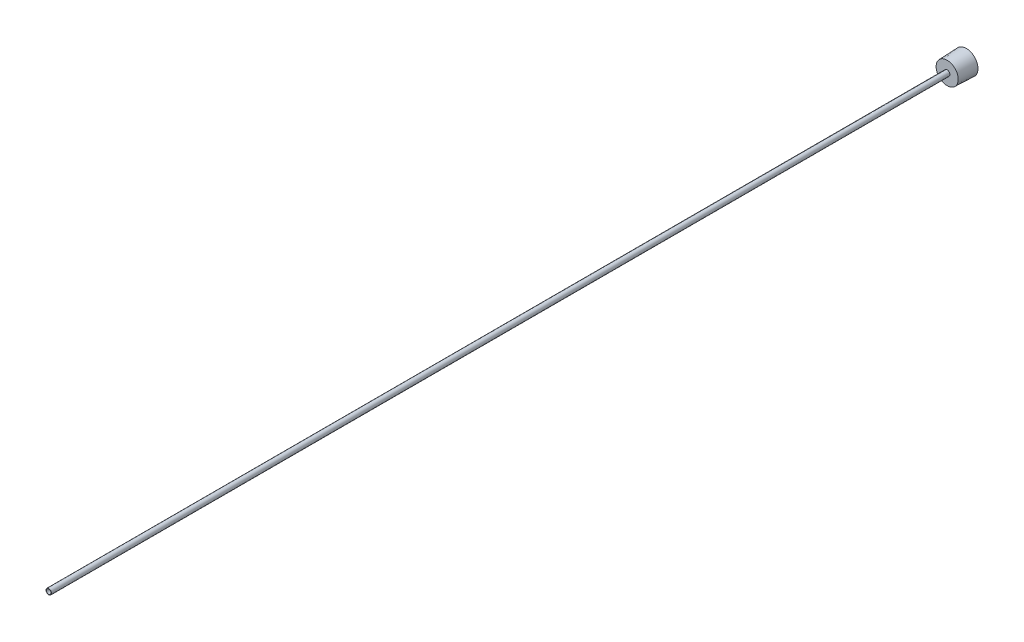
ISO-10303-21;
HEADER;
FILE_DESCRIPTION(('STEP AP214'),'2;1');
FILE_NAME('part.step','',(''),(''),'','','');
FILE_SCHEMA(('AUTOMOTIVE_DESIGN { 1 0 10303 214 1 1 1 1 }'));
ENDSEC;
DATA;
#1=APPLICATION_CONTEXT('core data for automotive mechanical design processes');
#2=APPLICATION_PROTOCOL_DEFINITION('international standard','automotive_design',2000,#1);
#3=PRODUCT_CONTEXT('',#1,'mechanical');
#4=PRODUCT('Part','Part','',(#3));
#5=PRODUCT_RELATED_PRODUCT_CATEGORY('part','',(#4));
#6=PRODUCT_DEFINITION_FORMATION('','',#4);
#7=PRODUCT_DEFINITION_CONTEXT('part definition',#1,'design');
#8=PRODUCT_DEFINITION('design','',#6,#7);
#9=PRODUCT_DEFINITION_SHAPE('','',#8);
#10=(LENGTH_UNIT() NAMED_UNIT(*) SI_UNIT(.MILLI.,.METRE.));
#11=(NAMED_UNIT(*) PLANE_ANGLE_UNIT() SI_UNIT($,.RADIAN.));
#12=(NAMED_UNIT(*) SI_UNIT($,.STERADIAN.) SOLID_ANGLE_UNIT());
#13=UNCERTAINTY_MEASURE_WITH_UNIT(LENGTH_MEASURE(1.E-05),#10,'distance_accuracy_value','');
#14=(GEOMETRIC_REPRESENTATION_CONTEXT(3) GLOBAL_UNCERTAINTY_ASSIGNED_CONTEXT((#13)) GLOBAL_UNIT_ASSIGNED_CONTEXT((#10,
#11,#12)) REPRESENTATION_CONTEXT('',''));
#15=CARTESIAN_POINT('',(0.,0.,0.));
#16=DIRECTION('',(0.,0.,1.));
#17=DIRECTION('',(1.,0.,0.));
#18=AXIS2_PLACEMENT_3D('',#15,#16,#17);
#19=CARTESIAN_POINT('',(0.,0.,0.));
#20=DIRECTION('',(0.,0.,1.));
#21=DIRECTION('',(1.,0.,0.));
#22=AXIS2_PLACEMENT_3D('',#19,#20,#21);
#23=CYLINDRICAL_SURFACE('',#22,0.762);
#24=CARTESIAN_POINT('',(0.,0.,304.8));
#25=DIRECTION('',(0.,0.,1.));
#26=DIRECTION('',(1.,0.,0.));
#27=AXIS2_PLACEMENT_3D('',#24,#25,#26);
#28=CIRCLE('',#27,0.762);
#29=CARTESIAN_POINT('',(0.762,0.,304.8));
#30=VERTEX_POINT('',#29);
#31=EDGE_CURVE('E142',#30,#30,#28,.T.);
#32=CARTESIAN_POINT('',(0.,0.,3.96875));
#33=DIRECTION('',(0.,0.,-1.));
#34=DIRECTION('',(-1.,0.,0.));
#35=AXIS2_PLACEMENT_3D('',#32,#33,#34);
#36=CIRCLE('',#35,0.762);
#37=CARTESIAN_POINT('',(0.762,0.,3.96875));
#38=VERTEX_POINT('',#37);
#39=EDGE_CURVE('E37',#38,#38,#36,.F.);
#40=CARTESIAN_POINT('',(0.762,0.,304.8));
#41=CARTESIAN_POINT('',(0.762,0.,301.666341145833));
#42=CARTESIAN_POINT('',(0.762,0.,298.532682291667));
#43=CARTESIAN_POINT('',(0.762,0.,292.265364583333));
#44=CARTESIAN_POINT('',(0.762,0.,289.131705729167));
#45=CARTESIAN_POINT('',(0.762,0.,282.864388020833));
#46=CARTESIAN_POINT('',(0.762,0.,279.730729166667));
#47=CARTESIAN_POINT('',(0.762,0.,273.463411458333));
#48=CARTESIAN_POINT('',(0.762,0.,270.329752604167));
#49=CARTESIAN_POINT('',(0.762,0.,264.062434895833));
#50=CARTESIAN_POINT('',(0.762,0.,260.928776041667));
#51=CARTESIAN_POINT('',(0.762,0.,254.661458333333));
#52=CARTESIAN_POINT('',(0.762,0.,251.527799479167));
#53=CARTESIAN_POINT('',(0.762,0.,245.260481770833));
#54=CARTESIAN_POINT('',(0.762,0.,242.126822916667));
#55=CARTESIAN_POINT('',(0.762,0.,235.859505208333));
#56=CARTESIAN_POINT('',(0.762,0.,232.725846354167));
#57=CARTESIAN_POINT('',(0.762,0.,226.458528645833));
#58=CARTESIAN_POINT('',(0.762,0.,223.324869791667));
#59=CARTESIAN_POINT('',(0.762,0.,217.057552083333));
#60=CARTESIAN_POINT('',(0.762,0.,213.923893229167));
#61=CARTESIAN_POINT('',(0.762,0.,207.656575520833));
#62=CARTESIAN_POINT('',(0.762,0.,204.522916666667));
#63=CARTESIAN_POINT('',(0.762,0.,198.255598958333));
#64=CARTESIAN_POINT('',(0.762,0.,195.121940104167));
#65=CARTESIAN_POINT('',(0.762,0.,188.854622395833));
#66=CARTESIAN_POINT('',(0.762,0.,185.720963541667));
#67=CARTESIAN_POINT('',(0.762,0.,179.453645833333));
#68=CARTESIAN_POINT('',(0.762,0.,176.319986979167));
#69=CARTESIAN_POINT('',(0.762,0.,170.052669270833));
#70=CARTESIAN_POINT('',(0.762,0.,166.919010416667));
#71=CARTESIAN_POINT('',(0.762,0.,160.651692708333));
#72=CARTESIAN_POINT('',(0.762,0.,157.518033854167));
#73=CARTESIAN_POINT('',(0.762,0.,151.250716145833));
#74=CARTESIAN_POINT('',(0.762,0.,148.117057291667));
#75=CARTESIAN_POINT('',(0.762,0.,141.849739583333));
#76=CARTESIAN_POINT('',(0.762,0.,138.716080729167));
#77=CARTESIAN_POINT('',(0.762,0.,132.448763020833));
#78=CARTESIAN_POINT('',(0.762,0.,129.315104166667));
#79=CARTESIAN_POINT('',(0.762,0.,123.047786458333));
#80=CARTESIAN_POINT('',(0.762,0.,119.914127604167));
#81=CARTESIAN_POINT('',(0.762,0.,113.646809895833));
#82=CARTESIAN_POINT('',(0.762,0.,110.513151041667));
#83=CARTESIAN_POINT('',(0.762,0.,104.245833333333));
#84=CARTESIAN_POINT('',(0.762,0.,101.112174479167));
#85=CARTESIAN_POINT('',(0.762,0.,94.8448567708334));
#86=CARTESIAN_POINT('',(0.762,0.,91.7111979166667));
#87=CARTESIAN_POINT('',(0.762,0.,85.4438802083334));
#88=CARTESIAN_POINT('',(0.762,0.,82.3102213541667));
#89=CARTESIAN_POINT('',(0.762,0.,76.0429036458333));
#90=CARTESIAN_POINT('',(0.762,0.,72.9092447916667));
#91=CARTESIAN_POINT('',(0.762,0.,66.6419270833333));
#92=CARTESIAN_POINT('',(0.762,0.,63.5082682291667));
#93=CARTESIAN_POINT('',(0.762,0.,57.2409505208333));
#94=CARTESIAN_POINT('',(0.762,0.,54.1072916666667));
#95=CARTESIAN_POINT('',(0.762,0.,47.8399739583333));
#96=CARTESIAN_POINT('',(0.762,0.,44.7063151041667));
#97=CARTESIAN_POINT('',(0.762,0.,38.4389973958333));
#98=CARTESIAN_POINT('',(0.762,0.,35.3053385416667));
#99=CARTESIAN_POINT('',(0.762,0.,29.0380208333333));
#100=CARTESIAN_POINT('',(0.762,0.,25.9043619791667));
#101=CARTESIAN_POINT('',(0.762,0.,19.6370442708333));
#102=CARTESIAN_POINT('',(0.762,0.,16.5033854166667));
#103=CARTESIAN_POINT('',(0.762,0.,10.2360677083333));
#104=CARTESIAN_POINT('',(0.762,0.,7.10240885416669));
#105=CARTESIAN_POINT('',(0.762,0.,3.96875000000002));
#106=B_SPLINE_CURVE_WITH_KNOTS('',3,(#40,#41,#42,#43,#44,#45,#46,#47,#48,#49,#50,#51,#52,#53,
#54,#55,#56,#57,#58,#59,#60,#61,#62,#63,#64,#65,#66,#67,#68,#69,#70,#71,#72,#73,#74,#75,#76,#77,
#78,#79,#80,#81,#82,#83,#84,#85,#86,#87,#88,#89,#90,#91,#92,#93,#94,#95,#96,#97,#98,#99,#100,
#101,#102,#103,#104,#105),.UNSPECIFIED.,.F.,.F.,(4,2,2,2,2,2,2,2,2,2,2,2,2,2,2,2,2,2,2,2,2,2,2,
2,2,2,2,2,2,2,2,2,4),(0.,9.4009765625,18.801953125,28.2029296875,37.60390625,47.0048828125,
56.405859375,65.8068359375,75.2078125,84.6087890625,94.009765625,103.4107421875,112.81171875,
122.2126953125,131.613671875,141.0146484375,150.415625,159.8166015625,169.217578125,
178.6185546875,188.01953125,197.4205078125,206.821484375,216.2224609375,225.6234375,
235.0244140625,244.425390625,253.8263671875,263.22734375,272.6283203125,282.029296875,
291.4302734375,300.83125),.UNSPECIFIED.);
#107=EDGE_CURVE('BSEAM33',#30,#38,#106,.T.);
#108=ORIENTED_EDGE('',*,*,#31,.T.);
#109=ORIENTED_EDGE('',*,*,#39,.F.);
#110=ORIENTED_EDGE('',*,*,#107,.T.);
#111=ORIENTED_EDGE('',*,*,#107,.F.);
#112=EDGE_LOOP('',(#108,#110,#109,#111));
#113=FACE_BOUND('',#112,.T.);
#114=ADVANCED_FACE('F33',(#113),#23,.F.);
#115=CARTESIAN_POINT('',(0.,0.,0.));
#116=DIRECTION('',(0.,0.,1.));
#117=DIRECTION('',(1.,0.,0.));
#118=AXIS2_PLACEMENT_3D('',#115,#116,#117);
#119=PLANE('',#118);
#120=DIRECTION('',(-0.866025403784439,0.5,0.));
#121=VECTOR('',#120,1.);
#122=CARTESIAN_POINT('',(0.,-2.74963065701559,0.));
#123=LINE('',#122,#121);
#124=CARTESIAN_POINT('',(0.,-2.74963065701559,0.));
#125=VERTEX_POINT('',#124);
#126=CARTESIAN_POINT('',(-2.38125,-1.3748153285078,0.));
#127=VERTEX_POINT('',#126);
#128=EDGE_CURVE('E124',#125,#127,#123,.T.);
#129=ORIENTED_EDGE('',*,*,#128,.F.);
#130=DIRECTION('',(-0.866025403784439,-0.5,0.));
#131=VECTOR('',#130,1.);
#132=CARTESIAN_POINT('',(2.38125,-1.3748153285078,0.));
#133=LINE('',#132,#131);
#134=CARTESIAN_POINT('',(2.38125,-1.3748153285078,0.));
#135=VERTEX_POINT('',#134);
#136=EDGE_CURVE('E49',#135,#125,#133,.T.);
#137=ORIENTED_EDGE('',*,*,#136,.F.);
#138=DIRECTION('',(0.,-1.,0.));
#139=VECTOR('',#138,1.);
#140=CARTESIAN_POINT('',(2.38125,1.3748153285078,0.));
#141=LINE('',#140,#139);
#142=CARTESIAN_POINT('',(2.38125,1.3748153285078,0.));
#143=VERTEX_POINT('',#142);
#144=EDGE_CURVE('E133',#143,#135,#141,.T.);
#145=ORIENTED_EDGE('',*,*,#144,.F.);
#146=DIRECTION('',(0.866025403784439,-0.5,0.));
#147=VECTOR('',#146,1.);
#148=CARTESIAN_POINT('',(0.,2.74963065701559,0.));
#149=LINE('',#148,#147);
#150=CARTESIAN_POINT('',(0.,2.74963065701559,0.));
#151=VERTEX_POINT('',#150);
#152=EDGE_CURVE('E131',#151,#143,#149,.T.);
#153=ORIENTED_EDGE('',*,*,#152,.F.);
#154=DIRECTION('',(0.866025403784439,0.5,0.));
#155=VECTOR('',#154,1.);
#156=CARTESIAN_POINT('',(-2.38125,1.3748153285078,0.));
#157=LINE('',#156,#155);
#158=CARTESIAN_POINT('',(-2.38125,1.3748153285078,0.));
#159=VERTEX_POINT('',#158);
#160=EDGE_CURVE('E97',#159,#151,#157,.T.);
#161=ORIENTED_EDGE('',*,*,#160,.F.);
#162=DIRECTION('',(0.,1.,0.));
#163=VECTOR('',#162,1.);
#164=CARTESIAN_POINT('',(-2.38125,-1.3748153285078,0.));
#165=LINE('',#164,#163);
#166=EDGE_CURVE('E127',#127,#159,#165,.T.);
#167=ORIENTED_EDGE('',*,*,#166,.F.);
#168=EDGE_LOOP('',(#129,#137,#145,#153,#161,#167));
#169=FACE_BOUND('',#168,.T.);
#170=CARTESIAN_POINT('',(0.,0.,0.));
#171=DIRECTION('',(0.,0.,1.));
#172=DIRECTION('',(1.,0.,0.));
#173=AXIS2_PLACEMENT_3D('',#170,#171,#172);
#174=CIRCLE('',#173,3.8989);
#175=CARTESIAN_POINT('',(3.8989,0.,0.));
#176=VERTEX_POINT('',#175);
#177=EDGE_CURVE('E11',#176,#176,#174,.T.);
#178=ORIENTED_EDGE('',*,*,#177,.F.);
#179=EDGE_LOOP('',(#178));
#180=FACE_BOUND('',#179,.T.);
#181=ADVANCED_FACE('F35',(#169,#180),#119,.F.);
#182=CARTESIAN_POINT('',(0.,0.,0.));
#183=DIRECTION('',(0.,0.,-1.));
#184=DIRECTION('',(-1.,0.,0.));
#185=AXIS2_PLACEMENT_3D('',#182,#183,#184);
#186=CONICAL_SURFACE('',#185,3.8989,0.0364424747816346);
#187=CARTESIAN_POINT('',(0.,0.,6.35));
#188=DIRECTION('',(0.,0.,1.));
#189=DIRECTION('',(1.,0.,0.));
#190=AXIS2_PLACEMENT_3D('',#187,#188,#189);
#191=CIRCLE('',#190,3.66738778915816);
#192=CARTESIAN_POINT('',(3.66738778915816,0.,6.35));
#193=VERTEX_POINT('',#192);
#194=EDGE_CURVE('E42',#193,#193,#191,.T.);
#195=ORIENTED_EDGE('',*,*,#194,.F.);
#196=EDGE_LOOP('',(#195));
#197=FACE_BOUND('',#196,.T.);
#198=ORIENTED_EDGE('',*,*,#177,.T.);
#199=EDGE_LOOP('',(#198));
#200=FACE_BOUND('',#199,.T.);
#201=ADVANCED_FACE('F156',(#197,#200),#186,.T.);
#202=CARTESIAN_POINT('',(0.,3.66738778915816,6.35));
#203=DIRECTION('',(0.,0.,-1.));
#204=DIRECTION('',(-1.,0.,0.));
#205=AXIS2_PLACEMENT_3D('',#202,#203,#204);
#206=PLANE('',#205);
#207=CARTESIAN_POINT('',(0.,0.,6.35));
#208=DIRECTION('',(0.,0.,1.));
#209=DIRECTION('',(1.,0.,0.));
#210=AXIS2_PLACEMENT_3D('',#207,#208,#209);
#211=CIRCLE('',#210,0.9144);
#212=CARTESIAN_POINT('',(0.9144,0.,6.35));
#213=VERTEX_POINT('',#212);
#214=EDGE_CURVE('E148',#213,#213,#211,.T.);
#215=ORIENTED_EDGE('',*,*,#214,.F.);
#216=EDGE_LOOP('',(#215));
#217=FACE_BOUND('',#216,.T.);
#218=ORIENTED_EDGE('',*,*,#194,.T.);
#219=EDGE_LOOP('',(#218));
#220=FACE_BOUND('',#219,.T.);
#221=ADVANCED_FACE('F154',(#217,#220),#206,.F.);
#222=CARTESIAN_POINT('',(0.,0.,0.));
#223=DIRECTION('',(0.,0.,1.));
#224=DIRECTION('',(1.,0.,0.));
#225=AXIS2_PLACEMENT_3D('',#222,#223,#224);
#226=CYLINDRICAL_SURFACE('',#225,0.914399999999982);
#227=CARTESIAN_POINT('',(0.,0.,304.8));
#228=DIRECTION('',(0.,0.,1.));
#229=DIRECTION('',(1.,0.,0.));
#230=AXIS2_PLACEMENT_3D('',#227,#228,#229);
#231=CIRCLE('',#230,0.914399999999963);
#232=CARTESIAN_POINT('',(0.914399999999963,0.,304.8));
#233=VERTEX_POINT('',#232);
#234=EDGE_CURVE('E145',#233,#233,#231,.T.);
#235=ORIENTED_EDGE('',*,*,#234,.F.);
#236=EDGE_LOOP('',(#235));
#237=FACE_BOUND('',#236,.T.);
#238=ORIENTED_EDGE('',*,*,#214,.T.);
#239=EDGE_LOOP('',(#238));
#240=FACE_BOUND('',#239,.T.);
#241=ADVANCED_FACE('F190',(#237,#240),#226,.T.);
#242=CARTESIAN_POINT('',(0.,0.914399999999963,304.8));
#243=DIRECTION('',(0.,0.,-1.));
#244=DIRECTION('',(-1.,0.,0.));
#245=AXIS2_PLACEMENT_3D('',#242,#243,#244);
#246=PLANE('',#245);
#247=ORIENTED_EDGE('',*,*,#31,.F.);
#248=EDGE_LOOP('',(#247));
#249=FACE_BOUND('',#248,.T.);
#250=ORIENTED_EDGE('',*,*,#234,.T.);
#251=EDGE_LOOP('',(#250));
#252=FACE_BOUND('',#251,.T.);
#253=ADVANCED_FACE('F183',(#249,#252),#246,.F.);
#254=CARTESIAN_POINT('',(0.,-2.74963065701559,3.96875));
#255=DIRECTION('',(0.,0.,-1.));
#256=DIRECTION('',(-1.,0.,0.));
#257=AXIS2_PLACEMENT_3D('',#254,#255,#256);
#258=PLANE('',#257);
#259=DIRECTION('',(-0.866025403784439,-0.5,0.));
#260=VECTOR('',#259,1.);
#261=CARTESIAN_POINT('',(2.38125,-1.3748153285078,3.96875));
#262=LINE('',#261,#260);
#263=CARTESIAN_POINT('',(2.38125,-1.3748153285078,3.96875));
#264=VERTEX_POINT('',#263);
#265=CARTESIAN_POINT('',(0.,-2.74963065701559,3.96875));
#266=VERTEX_POINT('',#265);
#267=EDGE_CURVE('E135',#264,#266,#262,.T.);
#268=ORIENTED_EDGE('',*,*,#267,.T.);
#269=DIRECTION('',(-0.866025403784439,0.5,0.));
#270=VECTOR('',#269,1.);
#271=CARTESIAN_POINT('',(0.,-2.74963065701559,3.96875));
#272=LINE('',#271,#270);
#273=CARTESIAN_POINT('',(-2.38125,-1.3748153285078,3.96875));
#274=VERTEX_POINT('',#273);
#275=EDGE_CURVE('E118',#266,#274,#272,.T.);
#276=ORIENTED_EDGE('',*,*,#275,.T.);
#277=DIRECTION('',(0.,1.,0.));
#278=VECTOR('',#277,1.);
#279=CARTESIAN_POINT('',(-2.38125,-1.3748153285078,3.96875));
#280=LINE('',#279,#278);
#281=CARTESIAN_POINT('',(-2.38125,1.3748153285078,3.96875));
#282=VERTEX_POINT('',#281);
#283=EDGE_CURVE('E116',#274,#282,#280,.T.);
#284=ORIENTED_EDGE('',*,*,#283,.T.);
#285=DIRECTION('',(0.866025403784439,0.5,0.));
#286=VECTOR('',#285,1.);
#287=CARTESIAN_POINT('',(-2.38125,1.3748153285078,3.96875));
#288=LINE('',#287,#286);
#289=CARTESIAN_POINT('',(0.,2.74963065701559,3.96875));
#290=VERTEX_POINT('',#289);
#291=EDGE_CURVE('E94',#282,#290,#288,.T.);
#292=ORIENTED_EDGE('',*,*,#291,.T.);
#293=DIRECTION('',(0.866025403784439,-0.5,0.));
#294=VECTOR('',#293,1.);
#295=CARTESIAN_POINT('',(0.,2.74963065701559,3.96875));
#296=LINE('',#295,#294);
#297=CARTESIAN_POINT('',(2.38125,1.3748153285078,3.96875));
#298=VERTEX_POINT('',#297);
#299=EDGE_CURVE('E105',#290,#298,#296,.T.);
#300=ORIENTED_EDGE('',*,*,#299,.T.);
#301=DIRECTION('',(0.,-1.,0.));
#302=VECTOR('',#301,1.);
#303=CARTESIAN_POINT('',(2.38125,1.3748153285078,3.96875));
#304=LINE('',#303,#302);
#305=EDGE_CURVE('E109',#298,#264,#304,.T.);
#306=ORIENTED_EDGE('',*,*,#305,.T.);
#307=EDGE_LOOP('',(#268,#276,#284,#292,#300,#306));
#308=FACE_BOUND('',#307,.T.);
#309=ORIENTED_EDGE('',*,*,#39,.T.);
#310=EDGE_LOOP('',(#309));
#311=FACE_BOUND('',#310,.T.);
#312=ADVANCED_FACE('F112',(#308,#311),#258,.T.);
#313=CARTESIAN_POINT('',(2.38125,-1.3748153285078,3.96875));
#314=DIRECTION('',(0.5,-0.866025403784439,0.));
#315=DIRECTION('',(0.866025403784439,0.5,0.));
#316=AXIS2_PLACEMENT_3D('',#313,#314,#315);
#317=PLANE('',#316);
#318=ORIENTED_EDGE('',*,*,#136,.T.);
#319=DIRECTION('',(0.,0.,-1.));
#320=VECTOR('',#319,1.);
#321=CARTESIAN_POINT('',(0.,-2.74963065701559,3.96875));
#322=LINE('',#321,#320);
#323=EDGE_CURVE('E79',#266,#125,#322,.T.);
#324=ORIENTED_EDGE('',*,*,#323,.F.);
#325=ORIENTED_EDGE('',*,*,#267,.F.);
#326=DIRECTION('',(0.,0.,-1.));
#327=VECTOR('',#326,1.);
#328=CARTESIAN_POINT('',(2.38125,-1.3748153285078,3.96875));
#329=LINE('',#328,#327);
#330=EDGE_CURVE('E57',#264,#135,#329,.T.);
#331=ORIENTED_EDGE('',*,*,#330,.T.);
#332=EDGE_LOOP('',(#318,#324,#325,#331));
#333=FACE_BOUND('',#332,.T.);
#334=ADVANCED_FACE('F174',(#333),#317,.F.);
#335=CARTESIAN_POINT('',(2.38125,1.3748153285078,3.96875));
#336=DIRECTION('',(1.,0.,0.));
#337=DIRECTION('',(0.,0.,-1.));
#338=AXIS2_PLACEMENT_3D('',#335,#336,#337);
#339=PLANE('',#338);
#340=ORIENTED_EDGE('',*,*,#144,.T.);
#341=ORIENTED_EDGE('',*,*,#330,.F.);
#342=ORIENTED_EDGE('',*,*,#305,.F.);
#343=DIRECTION('',(0.,0.,-1.));
#344=VECTOR('',#343,1.);
#345=CARTESIAN_POINT('',(2.38125,1.3748153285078,3.96875));
#346=LINE('',#345,#344);
#347=EDGE_CURVE('E101',#298,#143,#346,.T.);
#348=ORIENTED_EDGE('',*,*,#347,.T.);
#349=EDGE_LOOP('',(#340,#341,#342,#348));
#350=FACE_BOUND('',#349,.T.);
#351=ADVANCED_FACE('F176',(#350),#339,.F.);
#352=CARTESIAN_POINT('',(0.,2.74963065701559,3.96875));
#353=DIRECTION('',(0.5,0.866025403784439,0.));
#354=DIRECTION('',(-0.866025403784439,0.5,0.));
#355=AXIS2_PLACEMENT_3D('',#352,#353,#354);
#356=PLANE('',#355);
#357=ORIENTED_EDGE('',*,*,#152,.T.);
#358=ORIENTED_EDGE('',*,*,#347,.F.);
#359=ORIENTED_EDGE('',*,*,#299,.F.);
#360=DIRECTION('',(0.,0.,-1.));
#361=VECTOR('',#360,1.);
#362=CARTESIAN_POINT('',(0.,2.74963065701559,3.96875));
#363=LINE('',#362,#361);
#364=EDGE_CURVE('E90',#290,#151,#363,.T.);
#365=ORIENTED_EDGE('',*,*,#364,.T.);
#366=EDGE_LOOP('',(#357,#358,#359,#365));
#367=FACE_BOUND('',#366,.T.);
#368=ADVANCED_FACE('F106',(#367),#356,.F.);
#369=CARTESIAN_POINT('',(-2.38125,1.3748153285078,3.96875));
#370=DIRECTION('',(-0.5,0.866025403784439,0.));
#371=DIRECTION('',(-0.866025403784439,-0.5,0.));
#372=AXIS2_PLACEMENT_3D('',#369,#370,#371);
#373=PLANE('',#372);
#374=ORIENTED_EDGE('',*,*,#160,.T.);
#375=ORIENTED_EDGE('',*,*,#364,.F.);
#376=ORIENTED_EDGE('',*,*,#291,.F.);
#377=DIRECTION('',(0.,0.,-1.));
#378=VECTOR('',#377,1.);
#379=CARTESIAN_POINT('',(-2.38125,1.3748153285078,3.96875));
#380=LINE('',#379,#378);
#381=EDGE_CURVE('E102',#282,#159,#380,.T.);
#382=ORIENTED_EDGE('',*,*,#381,.T.);
#383=EDGE_LOOP('',(#374,#375,#376,#382));
#384=FACE_BOUND('',#383,.T.);
#385=ADVANCED_FACE('F92',(#384),#373,.F.);
#386=CARTESIAN_POINT('',(-2.38125,-1.3748153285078,3.96875));
#387=DIRECTION('',(-1.,0.,0.));
#388=DIRECTION('',(0.,0.,1.));
#389=AXIS2_PLACEMENT_3D('',#386,#387,#388);
#390=PLANE('',#389);
#391=ORIENTED_EDGE('',*,*,#166,.T.);
#392=ORIENTED_EDGE('',*,*,#381,.F.);
#393=ORIENTED_EDGE('',*,*,#283,.F.);
#394=DIRECTION('',(0.,0.,-1.));
#395=VECTOR('',#394,1.);
#396=CARTESIAN_POINT('',(-2.38125,-1.3748153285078,3.96875));
#397=LINE('',#396,#395);
#398=EDGE_CURVE('E139',#274,#127,#397,.T.);
#399=ORIENTED_EDGE('',*,*,#398,.T.);
#400=EDGE_LOOP('',(#391,#392,#393,#399));
#401=FACE_BOUND('',#400,.T.);
#402=ADVANCED_FACE('F246',(#401),#390,.F.);
#403=CARTESIAN_POINT('',(0.,-2.74963065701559,3.96875));
#404=DIRECTION('',(-0.5,-0.866025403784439,0.));
#405=DIRECTION('',(0.866025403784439,-0.5,0.));
#406=AXIS2_PLACEMENT_3D('',#403,#404,#405);
#407=PLANE('',#406);
#408=ORIENTED_EDGE('',*,*,#128,.T.);
#409=ORIENTED_EDGE('',*,*,#398,.F.);
#410=ORIENTED_EDGE('',*,*,#275,.F.);
#411=ORIENTED_EDGE('',*,*,#323,.T.);
#412=EDGE_LOOP('',(#408,#409,#410,#411));
#413=FACE_BOUND('',#412,.T.);
#414=ADVANCED_FACE('F172',(#413),#407,.F.);
#415=CLOSED_SHELL('',(#114,#181,#201,#221,#241,#253,#312,#334,#351,#368,#385,#402,#414));
#416=MANIFOLD_SOLID_BREP('B2',#415);
#417=ADVANCED_BREP_SHAPE_REPRESENTATION('',(#18,#416),#14);
#418=SHAPE_DEFINITION_REPRESENTATION(#9,#417);
ENDSEC;
END-ISO-10303-21;
